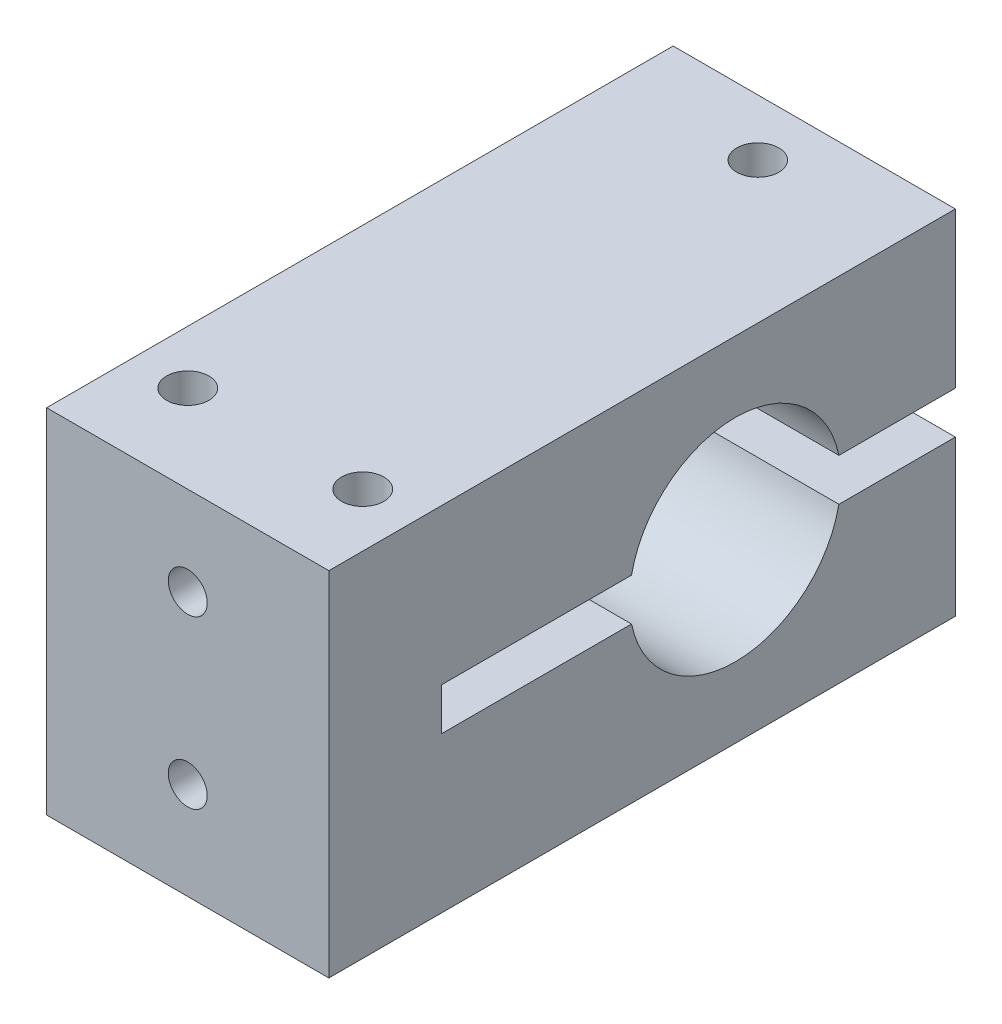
from build123d import *

# Parameters (mm, degrees)
SKETCH1_W                                           = 25.4
SKETCH1_H                                           = 56.388
EXTRUDE1_DEPTH                                      = 31.75
SKETCH2_R                                           = 9.525
CUT_EXTRUDE1_DEPTH                                  = 50.478521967
SKETCH3_W                                           = 50.8
SKETCH3_H                                           = 3.81
CUT_EXTRUDE2_DEPTH                                  = 50.478521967
SKETCH5_R                                           = 1.905
CUT_EXTRUDE8_DEPTH                                  = 45.319906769
F_6_32_TAPPED_HOLE1_D                               = 2.7051
F_6_32_TAPPED_HOLE1_DEPTH                           = 16.764
F_6_32_TAPPED_HOLE1_CBORE_D                         = 3.5052
F_6_32_TAPPED_HOLE1_CBORE_DEPTH                     = 12.7
F_6_32_TAPPED_HOLE1_TIP                             = 0.81269403
CBORE_FOR_6_BINDING_HEAD_MACHINE_SCREW1_D           = 3.7973
CBORE_FOR_6_BINDING_HEAD_MACHINE_SCREW1_CBORE_D     = 7.9375
CBORE_FOR_6_BINDING_HEAD_MACHINE_SCREW1_CBORE_DEPTH = 2.2098


with BuildPart() as part:
    # Sketch1 → Extrude1 (new body)
    with BuildSketch(Plane(origin=(0, 0, 0), x_dir=(1, 0, 0), z_dir=(0, 1, 0))):
        Rectangle(SKETCH1_W, SKETCH1_H)
    extrude(amount=EXTRUDE1_DEPTH)

    # Sketch2 → Cut-Extrude1 (cut, through all)
    with BuildSketch(Plane(origin=(12.7, 0, 0), x_dir=(0, 0, -1), z_dir=(1, 0, 0))):
        with Locations((8.382, 15.875)):
            Circle(SKETCH2_R)
    extrude(amount=-CUT_EXTRUDE1_DEPTH, mode=Mode.SUBTRACT)

    # Sketch3 → Cut-Extrude2 (cut, through all)
    with BuildSketch(Plane(origin=(12.7, 0, 0), x_dir=(0, 0, -1), z_dir=(1, 0, 0))):
        with Locations((7.366, 15.875)):
            Rectangle(SKETCH3_W, SKETCH3_H)
    extrude(amount=-CUT_EXTRUDE2_DEPTH, mode=Mode.SUBTRACT)

    # Sketch5 → Cut-Extrude8 (cut, through all)
    with BuildSketch(Plane(origin=(0, 31.75, 0), x_dir=(-1, 0, 0), z_dir=(0, 1, 0))):
        with Locations(Location((7.874, 20.32, 0), (0, 0, 90))):
            Circle(SKETCH5_R)
        with Locations(Location((-7.874, 20.32, 0), (0, 0, 90))):
            Circle(SKETCH5_R)
    extrude(amount=-CUT_EXTRUDE8_DEPTH, mode=Mode.SUBTRACT)

    # 6-32 Tapped Hole1
    with Locations(Plane(origin=(0, 23.749, 28.194), x_dir=(1, 0, 0), z_dir=(0, 0, 1))):
        with Locations((0, 0), (0, -15.013662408)):
            CounterBoreHole(F_6_32_TAPPED_HOLE1_D / 2, F_6_32_TAPPED_HOLE1_CBORE_D / 2, F_6_32_TAPPED_HOLE1_CBORE_DEPTH, depth=F_6_32_TAPPED_HOLE1_DEPTH)
            with Locations((0, 0, -(F_6_32_TAPPED_HOLE1_DEPTH + F_6_32_TAPPED_HOLE1_TIP / 2))):  # 118° drill point
                Cone(0, F_6_32_TAPPED_HOLE1_D / 2, F_6_32_TAPPED_HOLE1_TIP, mode=Mode.SUBTRACT)

    # CBORE for _6 Binding Head Machine Screw1 (through all)
    with Locations(Plane(origin=(0, 0, -23.114), x_dir=(0, 0, -1), z_dir=(0, -1, 0))):
        with Locations((0, 0)):
            CounterBoreHole(CBORE_FOR_6_BINDING_HEAD_MACHINE_SCREW1_D / 2, CBORE_FOR_6_BINDING_HEAD_MACHINE_SCREW1_CBORE_D / 2, CBORE_FOR_6_BINDING_HEAD_MACHINE_SCREW1_CBORE_DEPTH)


solid = part.part
